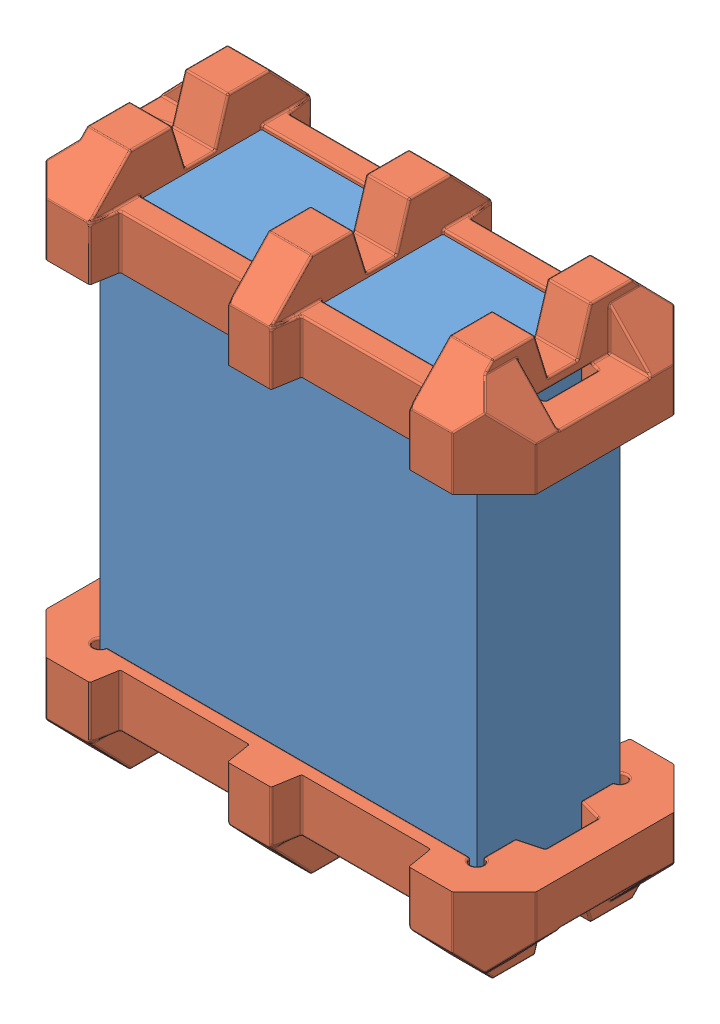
SolidWorks assembly Ensamblaje.SLDASM, configuration Predeterminado (file format 4400). Lengths in mm.
Overall size (562 614.91 254.2).
3 component instances, 2 part files, 0 mates.
Components (placement in the parent):
- Ordenador-1: Ordenador.SLDPRT [Default] at (71.8261 -282.5885 -5.0692) size (432 500 164)
- Molde-1: Molde.SLDPRT [Default] at (71.8261 161.2959 -5.0692) size (562 110 254.2)
- Molde-2: Molde.SLDPRT [Default] at (71.8261 -233.6188 -5.0692) x (1 0 0) z (0 0 -1) size (562 110 254.2)
